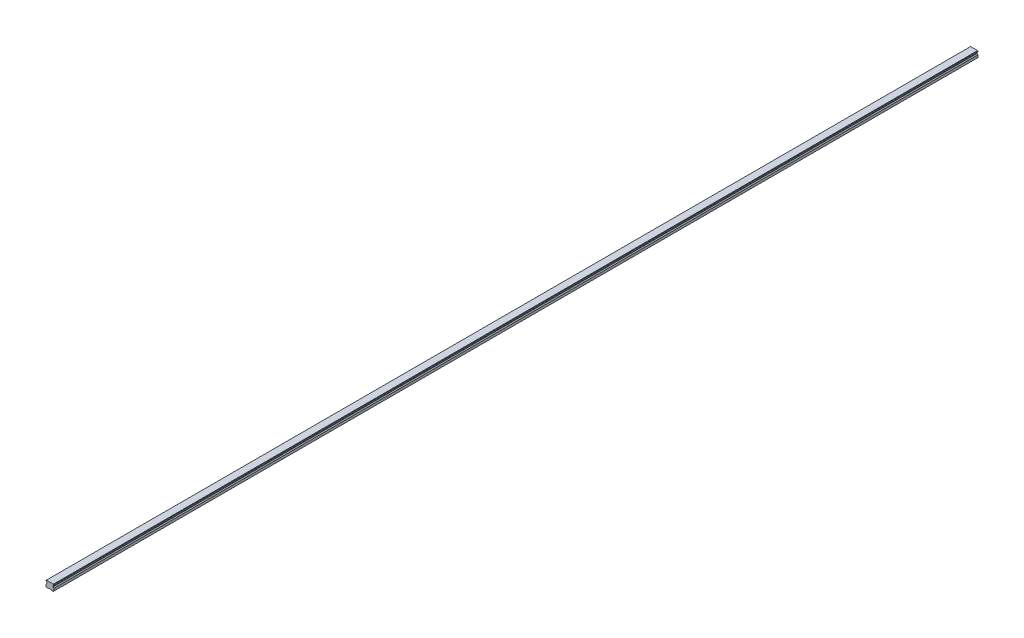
from build123d import *

# Parameters (mm, degrees)
SKETCH1_W           = 20
SKETCH1_H           = 16.3
BOSS_EXTRUDE1_DEPTH = 1190
CUT_EXTRUDE1_DEPTH  = 2381.07682439
CHAMFER1_SIZE       = 1
FILLET1_R           = 1
CUT_EXTRUDE2_DEPTH  = 2381.07682439
SKETCH5_R           = 3
SKETCH5_R_2         = 2.5
CUT_EXTRUDE5_DEPTH  = 10
SKETCH5_2_R         = 2.5
CUT_EXTRUDE6_DEPTH  = 13
LPATTERN2_COUNT     = 40
LPATTERN2_PITCH     = 60


with BuildPart() as part:
    # Sketch1 → Boss-Extrude1 (new, symmetric)
    with BuildSketch(Plane.XY):
        with Locations((0, 8.15)):
            Rectangle(SKETCH1_W, SKETCH1_H)
    extrude(amount=BOSS_EXTRUDE1_DEPTH, both=True)

    # Sketch2 → Cut-Extrude1 (cut, through all)
    with BuildSketch(Plane.XY.offset(1190)):
        Polygon((-10, 14.3), (-10, 7.3), (-7.666666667, 9.633333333), (-7.666666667, 11.966666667), align=None)
        Polygon((7.666666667, 11.966666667), (10, 14.3), (10, 7.3), (7.666666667, 9.633333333), align=None)
    extrude(amount=-CUT_EXTRUDE1_DEPTH, mode=Mode.SUBTRACT)

    # Chamfer1
    chamfer1_edges = [part.edges().sort_by_distance(p)[0] for p in [
        (-10, 16.3, 0),
        (10, 16.3, 0),
        (10, 0, 0),
        (-10, 0, 0),
    ]]
    chamfer(chamfer1_edges, length=CHAMFER1_SIZE)

    # Fillet1
    fillet1_edges = [part.edges().sort_by_distance(p)[0] for p in [
        (-7.666666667, 11.966666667, 0),
        (-7.666666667, 9.633333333, 0),
        (7.666666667, 9.633333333, 0),
        (7.666666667, 11.966666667, 0),
    ]]
    fillet(fillet1_edges, radius=FILLET1_R)

    # Sketch3 → Cut-Extrude2 (cut, through all)
    with BuildSketch(Plane.XY.offset(1190)):
        Polygon((-6, 0), (-5, 1), (5, 1), (6, 0), align=None)
    extrude(amount=-CUT_EXTRUDE2_DEPTH, mode=Mode.SUBTRACT)

    # Sketch5 → Cut-Extrude5 (cut)
    with BuildSketch(Plane.XZ.offset(-1)):
        with Locations(Location((0, 1170, 0), (0, 0, 270))):
            Circle(SKETCH5_R)
        with Locations(Location((0, 1170, 0), (0, 0, 270))):
            Circle(SKETCH5_R_2, mode=Mode.SUBTRACT)
    cut_extrude5 = extrude(amount=-CUT_EXTRUDE5_DEPTH, mode=Mode.SUBTRACT)

    # Sketch5_2 → Cut-Extrude6 (cut)
    with BuildSketch(Plane.XZ.offset(-1)):
        with Locations(Location((0, 1170, 0), (0, 0, 270))):
            Circle(SKETCH5_2_R)
    cut_extrude6 = extrude(amount=-CUT_EXTRUDE6_DEPTH, mode=Mode.SUBTRACT)

    # Cut-Extrude7 cone 1 section (on through the dimple's axis) → Cut-Extrude7 (revolve, cut)
    with BuildSketch(Plane(origin=(0, 14, 1170), x_dir=(0, 0, -1), z_dir=(1, 0, 0))):
        Polygon((0, 0), (2.5, 0), (0, 1.443375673), align=None)
    cut_extrude7 = revolve(axis=Axis((0, 14, 1170), (0, 1, 0)), mode=Mode.SUBTRACT)

    # LPattern2: Cut-Extrude5, Cut-Extrude6, Cut-Extrude7 ×40
    with Locations(*[(0, 0, -i * LPATTERN2_PITCH) for i in range(1, LPATTERN2_COUNT)]):
        add(cut_extrude5, mode=Mode.SUBTRACT)
        add(cut_extrude6, mode=Mode.SUBTRACT)
        add(cut_extrude7, mode=Mode.SUBTRACT)


solid = part.part
